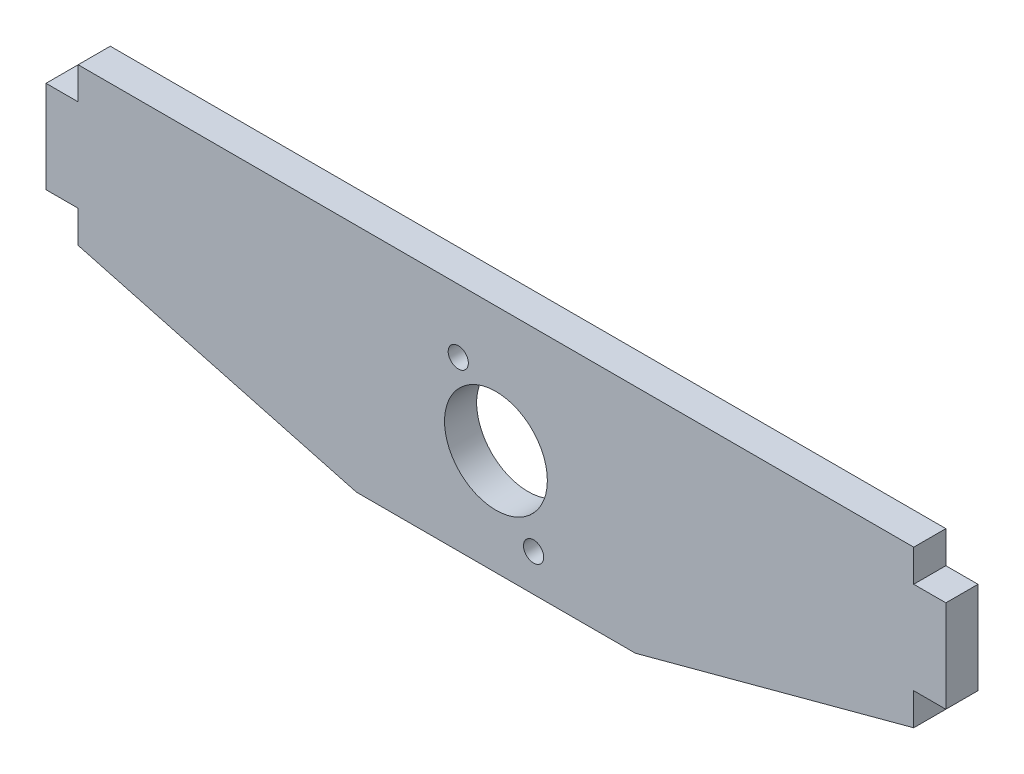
from build123d import *

# Parameters (mm, degrees)
SKETCH1_W                    = 88.9
SKETCH1_H                    = 25.4
BOSS_EXTRUDE1_DEPTH          = 1.5875
SKETCH2_W                    = 3.175
SKETCH2_H                    = 3.175
CUT_EXTRUDE1_DEPTH           = 47.337599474
SKETCH3_R                    = 5.08
CUT_EXTRUDE2_DEPTH           = 47.337599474
F_47_0_0785_DIAMETER_HOLE1_D = 1.9939
CUT_EXTRUDE4_DEPTH           = 47.337599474
CUT_EXTRUDE6_DEPTH           = 47.337599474


with BuildPart() as part:
    # Sketch1 → Boss-Extrude1 (new, symmetric)
    with BuildSketch(Plane.XY):
        Rectangle(SKETCH1_W, SKETCH1_H)
    extrude(amount=BOSS_EXTRUDE1_DEPTH, both=True)

    # Sketch2 → Cut-Extrude1 (cut, through all)
    with BuildSketch(Plane.XY.offset(1.5875)):
        with Locations((-42.8625, 11.1125)):
            Rectangle(SKETCH2_W, SKETCH2_H)
        with Locations((42.8625, 11.1125)):
            Rectangle(SKETCH2_W, SKETCH2_H)
        with Locations((42.8625, -11.1125)):
            Rectangle(SKETCH2_W, SKETCH2_H)
        with Locations((-42.8625, -11.1125)):
            Rectangle(SKETCH2_W, SKETCH2_H)
    extrude(amount=-CUT_EXTRUDE1_DEPTH, mode=Mode.SUBTRACT)

    # Sketch3 → Cut-Extrude2 (cut, through all)
    with BuildSketch(Plane.XY.offset(1.5875)):
        with Locations((0, 0.3048)):
            Circle(SKETCH3_R)
    extrude(amount=-CUT_EXTRUDE2_DEPTH, mode=Mode.SUBTRACT)

    # 47 _0.0785_ Diameter Hole1 (through all)
    with Locations(Plane.XY.offset(1.5875)):
        with Locations((-3.7211, 6.44513426), (3.7211, -6.44513426)):
            Hole(F_47_0_0785_DIAMETER_HOLE1_D / 2)

    # Sketch8 → Cut-Extrude4 (cut, through all)
    with BuildSketch(Plane.XY.offset(1.5875)):
        Polygon((-44.45, -1.905), (-13.781855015, -10.122504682), (13.781855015, -10.122504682), (44.45, -1.905), (44.45, -9.525), (41.275, -9.525), (41.275, -12.7), (-41.275, -12.7), (-41.275, -9.525), (-44.45, -9.525), align=None)
    extrude(amount=-CUT_EXTRUDE4_DEPTH, mode=Mode.SUBTRACT)

    # Sketch10 → Cut-Extrude6 (cut, through all)
    with BuildSketch(Plane.XY.offset(1.5875)):
        Polygon((-44.45, -1.905), (-41.275, -2.755738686), (-41.275, 0.419261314), (-44.45, 0.419261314), align=None)
        Polygon((44.45, 0.419261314), (44.45, -1.905), (41.275, -2.755738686), (41.275, 0.419261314), align=None)
    extrude(amount=-CUT_EXTRUDE6_DEPTH, mode=Mode.SUBTRACT)


solid = part.part
